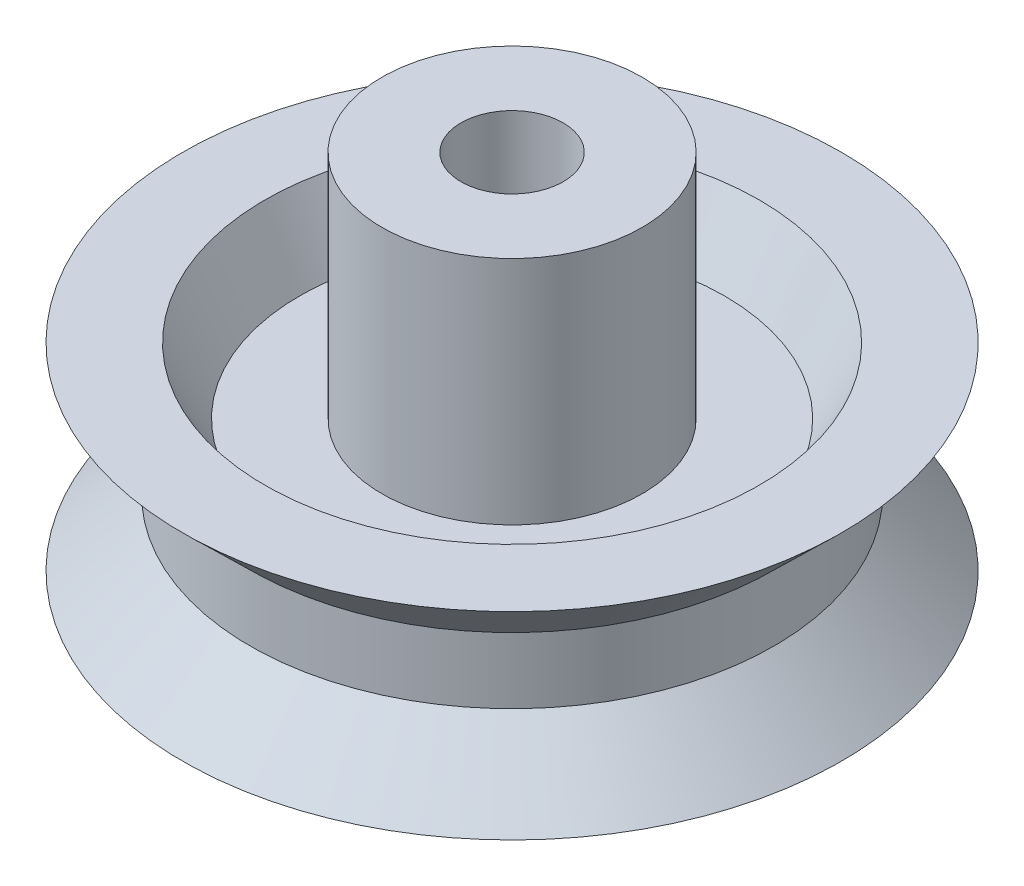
from build123d import *


with BuildPart() as part:
    # Esquisse2 → R_volution1 (revolve)
    with BuildSketch(Plane(origin=(0, 0, 0), x_dir=(0, 0, -1), z_dir=(1, 0, 0))):
        Polygon((1.55, 0), (3.95, 0), (3.95, 2), (6.45, 2), (7.5, 0), (10, 0), (7.95, 2), (7.95, 4), (10, 6), (7.5, 6), (6.45, 4), (3.95, 4), (3.95, 11), (1.55, 11), align=None)
    revolve(axis=Axis((0, -10.35463065, 0), (0, 1, 0)))


solid = part.part
